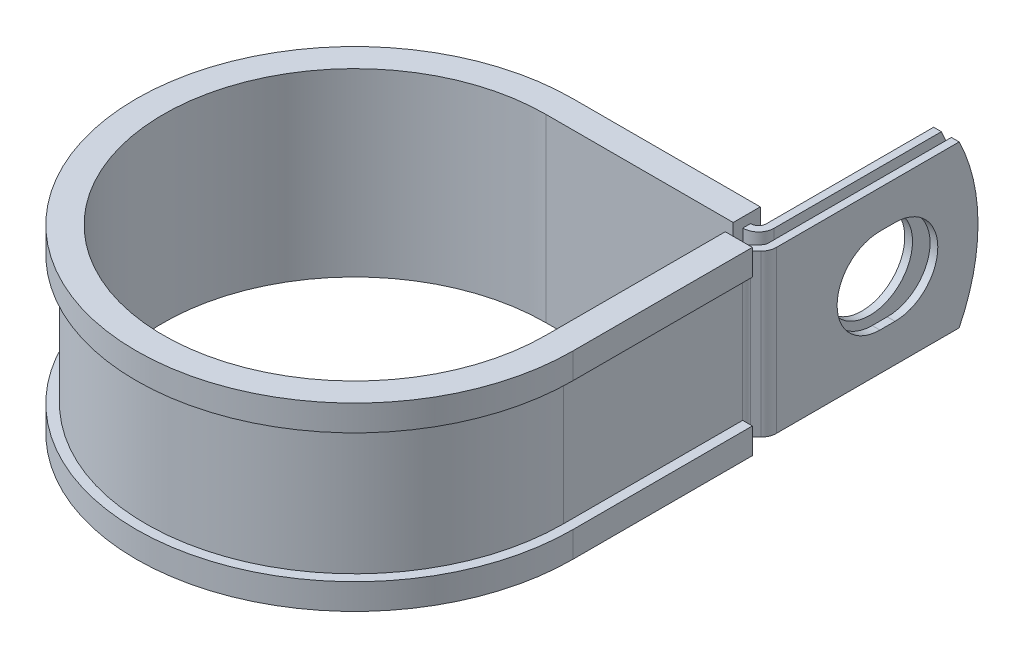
ISO-10303-21;
HEADER;
FILE_DESCRIPTION(('STEP AP214'),'2;1');
FILE_NAME('part.step','',(''),(''),'','','');
FILE_SCHEMA(('AUTOMOTIVE_DESIGN { 1 0 10303 214 1 1 1 1 }'));
ENDSEC;
DATA;
#1=APPLICATION_CONTEXT('core data for automotive mechanical design processes');
#2=APPLICATION_PROTOCOL_DEFINITION('international standard','automotive_design',2000,#1);
#3=PRODUCT_CONTEXT('',#1,'mechanical');
#4=PRODUCT('Part','Part','',(#3));
#5=PRODUCT_RELATED_PRODUCT_CATEGORY('part','',(#4));
#6=PRODUCT_DEFINITION_FORMATION('','',#4);
#7=PRODUCT_DEFINITION_CONTEXT('part definition',#1,'design');
#8=PRODUCT_DEFINITION('design','',#6,#7);
#9=PRODUCT_DEFINITION_SHAPE('','',#8);
#10=(LENGTH_UNIT() NAMED_UNIT(*) SI_UNIT(.MILLI.,.METRE.));
#11=(NAMED_UNIT(*) PLANE_ANGLE_UNIT() SI_UNIT($,.RADIAN.));
#12=(NAMED_UNIT(*) SI_UNIT($,.STERADIAN.) SOLID_ANGLE_UNIT());
#13=UNCERTAINTY_MEASURE_WITH_UNIT(LENGTH_MEASURE(1.E-05),#10,'distance_accuracy_value','');
#14=(GEOMETRIC_REPRESENTATION_CONTEXT(3) GLOBAL_UNCERTAINTY_ASSIGNED_CONTEXT((#13)) GLOBAL_UNIT_ASSIGNED_CONTEXT((#10,
#11,#12)) REPRESENTATION_CONTEXT('',''));
#15=CARTESIAN_POINT('',(0.,0.,0.));
#16=DIRECTION('',(0.,0.,1.));
#17=DIRECTION('',(1.,0.,0.));
#18=AXIS2_PLACEMENT_3D('',#15,#16,#17);
#19=CARTESIAN_POINT('',(32.3647698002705,-12.7,-31.6865));
#20=DIRECTION('',(0.,1.,0.));
#21=DIRECTION('',(1.,0.,0.));
#22=AXIS2_PLACEMENT_3D('',#19,#20,#21);
#23=PLANE('',#22);
#24=DIRECTION('',(0.,0.,-1.));
#25=VECTOR('',#24,1.);
#26=CARTESIAN_POINT('',(29.5199698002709,-12.7,-31.6865));
#27=LINE('',#26,#25);
#28=CARTESIAN_POINT('',(29.5199698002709,-12.7,-31.6865));
#29=VERTEX_POINT('',#28);
#30=CARTESIAN_POINT('',(29.5199698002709,-12.7,-32.9057));
#31=VERTEX_POINT('',#30);
#32=EDGE_CURVE('E505',#29,#31,#27,.T.);
#33=ORIENTED_EDGE('',*,*,#32,.T.);
#34=DIRECTION('',(1.,0.,0.));
#35=VECTOR('',#34,1.);
#36=CARTESIAN_POINT('',(0.,-12.7,-32.9057));
#37=LINE('',#36,#35);
#38=CARTESIAN_POINT('',(29.5707698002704,-12.7,-32.9057));
#39=VERTEX_POINT('',#38);
#40=EDGE_CURVE('E392',#39,#31,#37,.F.);
#41=ORIENTED_EDGE('',*,*,#40,.F.);
#42=CARTESIAN_POINT('',(29.5707698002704,-12.7,-34.1249));
#43=DIRECTION('',(0.,1.,0.));
#44=DIRECTION('',(1.,0.,0.));
#45=AXIS2_PLACEMENT_3D('',#42,#43,#44);
#46=CIRCLE('',#45,1.2192);
#47=CARTESIAN_POINT('',(30.7899698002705,-12.7,-34.1249));
#48=VERTEX_POINT('',#47);
#49=EDGE_CURVE('E390',#48,#39,#46,.F.);
#50=ORIENTED_EDGE('',*,*,#49,.F.);
#51=DIRECTION('',(0.,0.,1.));
#52=VECTOR('',#51,1.);
#53=CARTESIAN_POINT('',(30.7899698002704,-12.7,-63.4746));
#54=LINE('',#53,#52);
#55=CARTESIAN_POINT('',(30.7899698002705,-12.7,-60.4972683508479));
#56=VERTEX_POINT('',#55);
#57=EDGE_CURVE('E388',#56,#48,#54,.T.);
#58=ORIENTED_EDGE('',*,*,#57,.F.);
#59=DIRECTION('',(-1.,0.,0.));
#60=VECTOR('',#59,1.);
#61=CARTESIAN_POINT('',(34.8031698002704,-12.7,-60.4972683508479));
#62=LINE('',#61,#60);
#63=CARTESIAN_POINT('',(32.0091698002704,-12.7,-60.4972683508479));
#64=VERTEX_POINT('',#63);
#65=EDGE_CURVE('E11',#64,#56,#62,.T.);
#66=ORIENTED_EDGE('',*,*,#65,.F.);
#67=DIRECTION('',(0.,0.,1.));
#68=VECTOR('',#67,1.);
#69=CARTESIAN_POINT('',(32.0091698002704,-12.7,-63.4746));
#70=LINE('',#69,#68);
#71=CARTESIAN_POINT('',(32.0091698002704,-12.7,-34.1249));
#72=VERTEX_POINT('',#71);
#73=EDGE_CURVE('E386',#64,#72,#70,.T.);
#74=ORIENTED_EDGE('',*,*,#73,.T.);
#75=CARTESIAN_POINT('',(29.5707698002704,-12.7,-34.1249));
#76=DIRECTION('',(0.,-1.,0.));
#77=DIRECTION('',(0.,0.,1.));
#78=AXIS2_PLACEMENT_3D('',#75,#76,#77);
#79=CIRCLE('',#78,2.4384);
#80=CARTESIAN_POINT('',(29.5707698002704,-12.7,-31.6865));
#81=VERTEX_POINT('',#80);
#82=EDGE_CURVE('E383',#72,#81,#79,.T.);
#83=ORIENTED_EDGE('',*,*,#82,.T.);
#84=DIRECTION('',(-1.,0.,0.));
#85=VECTOR('',#84,1.);
#86=CARTESIAN_POINT('',(0.,-12.7,-31.6865));
#87=LINE('',#86,#85);
#88=EDGE_CURVE('E380',#81,#29,#87,.T.);
#89=ORIENTED_EDGE('',*,*,#88,.T.);
#90=EDGE_LOOP('',(#33,#41,#50,#58,#66,#74,#83,#89));
#91=FACE_BOUND('',#90,.T.);
#92=ADVANCED_FACE('F36',(#91),#23,.F.);
#93=CARTESIAN_POINT('',(32.3647698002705,12.7,-31.6865));
#94=DIRECTION('',(0.,1.,0.));
#95=DIRECTION('',(1.,0.,0.));
#96=AXIS2_PLACEMENT_3D('',#93,#94,#95);
#97=PLANE('',#96);
#98=DIRECTION('',(1.,0.,0.));
#99=VECTOR('',#98,1.);
#100=CARTESIAN_POINT('',(0.,12.7,-32.9057));
#101=LINE('',#100,#99);
#102=CARTESIAN_POINT('',(29.5707698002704,12.7,-32.9057));
#103=VERTEX_POINT('',#102);
#104=CARTESIAN_POINT('',(29.5199698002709,12.7,-32.9057));
#105=VERTEX_POINT('',#104);
#106=EDGE_CURVE('E350',#103,#105,#101,.F.);
#107=ORIENTED_EDGE('',*,*,#106,.T.);
#108=DIRECTION('',(0.,0.,1.));
#109=VECTOR('',#108,1.);
#110=CARTESIAN_POINT('',(29.5199698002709,12.7,-32.9057));
#111=LINE('',#110,#109);
#112=CARTESIAN_POINT('',(29.5199698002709,12.7,-31.6865));
#113=VERTEX_POINT('',#112);
#114=EDGE_CURVE('E499',#105,#113,#111,.T.);
#115=ORIENTED_EDGE('',*,*,#114,.T.);
#116=DIRECTION('',(-1.,0.,0.));
#117=VECTOR('',#116,1.);
#118=CARTESIAN_POINT('',(0.,12.7,-31.6865));
#119=LINE('',#118,#117);
#120=CARTESIAN_POINT('',(29.5707698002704,12.7,-31.6865));
#121=VERTEX_POINT('',#120);
#122=EDGE_CURVE('E607',#121,#113,#119,.T.);
#123=ORIENTED_EDGE('',*,*,#122,.F.);
#124=CARTESIAN_POINT('',(29.5707698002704,12.7,-34.1249));
#125=DIRECTION('',(0.,-1.,0.));
#126=DIRECTION('',(0.,0.,1.));
#127=AXIS2_PLACEMENT_3D('',#124,#125,#126);
#128=CIRCLE('',#127,2.4384);
#129=CARTESIAN_POINT('',(32.0091698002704,12.7,-34.1249));
#130=VERTEX_POINT('',#129);
#131=EDGE_CURVE('E352',#130,#121,#128,.T.);
#132=ORIENTED_EDGE('',*,*,#131,.F.);
#133=DIRECTION('',(0.,0.,1.));
#134=VECTOR('',#133,1.);
#135=CARTESIAN_POINT('',(32.0091698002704,12.7,-63.4746));
#136=LINE('',#135,#134);
#137=CARTESIAN_POINT('',(32.0091698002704,12.7,-60.4972683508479));
#138=VERTEX_POINT('',#137);
#139=EDGE_CURVE('E343',#138,#130,#136,.T.);
#140=ORIENTED_EDGE('',*,*,#139,.F.);
#141=DIRECTION('',(-1.,0.,0.));
#142=VECTOR('',#141,1.);
#143=CARTESIAN_POINT('',(34.8031698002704,12.7,-60.4972683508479));
#144=LINE('',#143,#142);
#145=CARTESIAN_POINT('',(30.7899698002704,12.7,-60.4972683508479));
#146=VERTEX_POINT('',#145);
#147=EDGE_CURVE('E44',#138,#146,#144,.T.);
#148=ORIENTED_EDGE('',*,*,#147,.T.);
#149=DIRECTION('',(0.,0.,1.));
#150=VECTOR('',#149,1.);
#151=CARTESIAN_POINT('',(30.7899698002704,12.7,-63.4746));
#152=LINE('',#151,#150);
#153=CARTESIAN_POINT('',(30.7899698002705,12.7,-34.1249));
#154=VERTEX_POINT('',#153);
#155=EDGE_CURVE('E340',#146,#154,#152,.T.);
#156=ORIENTED_EDGE('',*,*,#155,.T.);
#157=CARTESIAN_POINT('',(29.5707698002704,12.7,-34.1249));
#158=DIRECTION('',(0.,1.,0.));
#159=DIRECTION('',(1.,0.,0.));
#160=AXIS2_PLACEMENT_3D('',#157,#158,#159);
#161=CIRCLE('',#160,1.2192);
#162=EDGE_CURVE('E348',#154,#103,#161,.F.);
#163=ORIENTED_EDGE('',*,*,#162,.T.);
#164=EDGE_LOOP('',(#107,#115,#123,#132,#140,#148,#156,#163));
#165=FACE_BOUND('',#164,.T.);
#166=ADVANCED_FACE('F339',(#165),#97,.T.);
#167=CARTESIAN_POINT('',(0.,12.7,-31.6865));
#168=DIRECTION('',(0.,0.,1.));
#169=DIRECTION('',(1.,0.,0.));
#170=AXIS2_PLACEMENT_3D('',#167,#168,#169);
#171=PLANE('',#170);
#172=ORIENTED_EDGE('',*,*,#122,.T.);
#173=DIRECTION('',(0.,-1.,0.));
#174=VECTOR('',#173,1.);
#175=CARTESIAN_POINT('',(29.5199698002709,12.7,-31.6865));
#176=LINE('',#175,#174);
#177=EDGE_CURVE('E502',#113,#29,#176,.T.);
#178=ORIENTED_EDGE('',*,*,#177,.T.);
#179=ORIENTED_EDGE('',*,*,#88,.F.);
#180=DIRECTION('',(0.,-1.,0.));
#181=VECTOR('',#180,1.);
#182=CARTESIAN_POINT('',(29.5707698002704,12.7,-31.6865));
#183=LINE('',#182,#181);
#184=EDGE_CURVE('E326',#121,#81,#183,.T.);
#185=ORIENTED_EDGE('',*,*,#184,.F.);
#186=EDGE_LOOP('',(#172,#178,#179,#185));
#187=FACE_BOUND('',#186,.T.);
#188=ADVANCED_FACE('F617',(#187),#171,.T.);
#189=CARTESIAN_POINT('',(34.8031698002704,12.7,-31.6865));
#190=DIRECTION('',(-1.,0.,0.));
#191=DIRECTION('',(0.,0.,1.));
#192=AXIS2_PLACEMENT_3D('',#189,#190,#191);
#193=PLANE('',#192);
#194=CARTESIAN_POINT('',(34.8031698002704,0.,-50.3935999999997));
#195=DIRECTION('',(1.,0.,0.));
#196=DIRECTION('',(0.,0.,-1.));
#197=AXIS2_PLACEMENT_3D('',#194,#195,#196);
#198=CIRCLE('',#197,6.7437);
#199=CARTESIAN_POINT('',(34.8031698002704,-6.7437,-50.3936000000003));
#200=VERTEX_POINT('',#199);
#201=CARTESIAN_POINT('',(34.8031698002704,6.7437,-50.3936000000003));
#202=VERTEX_POINT('',#201);
#203=EDGE_CURVE('E562',#200,#202,#198,.T.);
#204=ORIENTED_EDGE('',*,*,#203,.F.);
#205=DIRECTION('',(0.,0.,-1.));
#206=VECTOR('',#205,1.);
#207=CARTESIAN_POINT('',(34.8031698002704,-6.7437,-48.0059999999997));
#208=LINE('',#207,#206);
#209=CARTESIAN_POINT('',(34.8031698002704,-6.7437,-48.0059999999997));
#210=VERTEX_POINT('',#209);
#211=EDGE_CURVE('E565',#210,#200,#208,.T.);
#212=ORIENTED_EDGE('',*,*,#211,.F.);
#213=CARTESIAN_POINT('',(34.8031698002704,0.,-48.0059999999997));
#214=DIRECTION('',(1.,0.,0.));
#215=DIRECTION('',(0.,0.,-1.));
#216=AXIS2_PLACEMENT_3D('',#213,#214,#215);
#217=CIRCLE('',#216,6.7437);
#218=CARTESIAN_POINT('',(34.8031698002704,6.7437,-48.0059999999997));
#219=VERTEX_POINT('',#218);
#220=EDGE_CURVE('E558',#219,#210,#217,.T.);
#221=ORIENTED_EDGE('',*,*,#220,.F.);
#222=DIRECTION('',(0.,0.,1.));
#223=VECTOR('',#222,1.);
#224=CARTESIAN_POINT('',(34.8031698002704,6.7437,-48.0059999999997));
#225=LINE('',#224,#223);
#226=EDGE_CURVE('E559',#202,#219,#225,.T.);
#227=ORIENTED_EDGE('',*,*,#226,.F.);
#228=EDGE_LOOP('',(#204,#212,#221,#227));
#229=FACE_BOUND('',#228,.T.);
#230=DIRECTION('',(0.,0.,-1.));
#231=VECTOR('',#230,1.);
#232=CARTESIAN_POINT('',(34.8031698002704,-12.7,-31.6865));
#233=LINE('',#232,#231);
#234=CARTESIAN_POINT('',(34.8031698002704,-12.7,-31.6865));
#235=VERTEX_POINT('',#234);
#236=CARTESIAN_POINT('',(34.8031698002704,-12.7,-60.4972683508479));
#237=VERTEX_POINT('',#236);
#238=EDGE_CURVE('E364',#235,#237,#233,.T.);
#239=ORIENTED_EDGE('',*,*,#238,.T.);
#240=CARTESIAN_POINT('',(34.8031698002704,0.,-34.8996));
#241=DIRECTION('',(-1.,0.,0.));
#242=DIRECTION('',(0.,0.,1.));
#243=AXIS2_PLACEMENT_3D('',#240,#241,#242);
#244=CIRCLE('',#243,28.575);
#245=CARTESIAN_POINT('',(34.8031698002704,12.7,-60.4972683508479));
#246=VERTEX_POINT('',#245);
#247=EDGE_CURVE('E550',#246,#237,#244,.T.);
#248=ORIENTED_EDGE('',*,*,#247,.F.);
#249=DIRECTION('',(0.,0.,-1.));
#250=VECTOR('',#249,1.);
#251=CARTESIAN_POINT('',(34.8031698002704,12.7,-31.6865));
#252=LINE('',#251,#250);
#253=CARTESIAN_POINT('',(34.8031698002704,12.7,-31.6865));
#254=VERTEX_POINT('',#253);
#255=EDGE_CURVE('E401',#254,#246,#252,.T.);
#256=ORIENTED_EDGE('',*,*,#255,.F.);
#257=DIRECTION('',(0.,-1.,0.));
#258=VECTOR('',#257,1.);
#259=CARTESIAN_POINT('',(34.8031698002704,12.7,-31.6865));
#260=LINE('',#259,#258);
#261=EDGE_CURVE('E363',#254,#235,#260,.T.);
#262=ORIENTED_EDGE('',*,*,#261,.T.);
#263=EDGE_LOOP('',(#239,#248,#256,#262));
#264=FACE_BOUND('',#263,.T.);
#265=ADVANCED_FACE('F38',(#229,#264),#193,.F.);
#266=CARTESIAN_POINT('',(33.5839698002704,12.7,-31.6865));
#267=DIRECTION('',(-1.,0.,0.));
#268=DIRECTION('',(0.,0.,1.));
#269=AXIS2_PLACEMENT_3D('',#266,#267,#268);
#270=PLANE('',#269);
#271=DIRECTION('',(0.,0.,-1.));
#272=VECTOR('',#271,1.);
#273=CARTESIAN_POINT('',(33.5839698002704,-6.7437,-48.0059999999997));
#274=LINE('',#273,#272);
#275=CARTESIAN_POINT('',(33.5839698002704,-6.7437,-48.0059999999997));
#276=VERTEX_POINT('',#275);
#277=CARTESIAN_POINT('',(33.5839698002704,-6.7437,-50.3936000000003));
#278=VERTEX_POINT('',#277);
#279=EDGE_CURVE('E561',#276,#278,#274,.T.);
#280=ORIENTED_EDGE('',*,*,#279,.T.);
#281=CARTESIAN_POINT('',(33.5839698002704,0.,-50.3935999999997));
#282=DIRECTION('',(-1.,0.,0.));
#283=DIRECTION('',(0.,0.,1.));
#284=AXIS2_PLACEMENT_3D('',#281,#282,#283);
#285=CIRCLE('',#284,6.7437);
#286=CARTESIAN_POINT('',(33.5839698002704,6.7437,-50.3936000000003));
#287=VERTEX_POINT('',#286);
#288=EDGE_CURVE('E582',#278,#287,#285,.F.);
#289=ORIENTED_EDGE('',*,*,#288,.T.);
#290=DIRECTION('',(0.,0.,1.));
#291=VECTOR('',#290,1.);
#292=CARTESIAN_POINT('',(33.5839698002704,6.7437,-48.0059999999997));
#293=LINE('',#292,#291);
#294=CARTESIAN_POINT('',(33.5839698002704,6.7437,-48.0059999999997));
#295=VERTEX_POINT('',#294);
#296=EDGE_CURVE('E578',#287,#295,#293,.T.);
#297=ORIENTED_EDGE('',*,*,#296,.T.);
#298=CARTESIAN_POINT('',(33.5839698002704,0.,-48.0059999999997));
#299=DIRECTION('',(-1.,0.,0.));
#300=DIRECTION('',(0.,0.,1.));
#301=AXIS2_PLACEMENT_3D('',#298,#299,#300);
#302=CIRCLE('',#301,6.7437);
#303=EDGE_CURVE('E573',#295,#276,#302,.F.);
#304=ORIENTED_EDGE('',*,*,#303,.T.);
#305=EDGE_LOOP('',(#280,#289,#297,#304));
#306=FACE_BOUND('',#305,.T.);
#307=CARTESIAN_POINT('',(33.5839698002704,0.,-34.8996));
#308=DIRECTION('',(-1.,0.,0.));
#309=DIRECTION('',(0.,0.,1.));
#310=AXIS2_PLACEMENT_3D('',#307,#308,#309);
#311=CIRCLE('',#310,28.575);
#312=CARTESIAN_POINT('',(33.5839698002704,12.7,-60.4972683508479));
#313=VERTEX_POINT('',#312);
#314=CARTESIAN_POINT('',(33.5839698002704,-12.7,-60.4972683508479));
#315=VERTEX_POINT('',#314);
#316=EDGE_CURVE('E58',#313,#315,#311,.T.);
#317=ORIENTED_EDGE('',*,*,#316,.T.);
#318=DIRECTION('',(0.,0.,-1.));
#319=VECTOR('',#318,1.);
#320=CARTESIAN_POINT('',(33.5839698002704,-12.7,-31.6865));
#321=LINE('',#320,#319);
#322=CARTESIAN_POINT('',(33.5839698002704,-12.7,-31.6865));
#323=VERTEX_POINT('',#322);
#324=EDGE_CURVE('E367',#323,#315,#321,.T.);
#325=ORIENTED_EDGE('',*,*,#324,.F.);
#326=DIRECTION('',(0.,-1.,0.));
#327=VECTOR('',#326,1.);
#328=CARTESIAN_POINT('',(33.5839698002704,12.7,-31.6865));
#329=LINE('',#328,#327);
#330=CARTESIAN_POINT('',(33.5839698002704,12.7,-31.6865));
#331=VERTEX_POINT('',#330);
#332=EDGE_CURVE('E334',#331,#323,#329,.T.);
#333=ORIENTED_EDGE('',*,*,#332,.F.);
#334=DIRECTION('',(0.,0.,-1.));
#335=VECTOR('',#334,1.);
#336=CARTESIAN_POINT('',(33.5839698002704,12.7,-31.6865));
#337=LINE('',#336,#335);
#338=EDGE_CURVE('E597',#331,#313,#337,.T.);
#339=ORIENTED_EDGE('',*,*,#338,.T.);
#340=EDGE_LOOP('',(#317,#325,#333,#339));
#341=FACE_BOUND('',#340,.T.);
#342=ADVANCED_FACE('F671',(#306,#341),#270,.T.);
#343=CARTESIAN_POINT('',(32.0091698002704,12.7,-63.4746));
#344=DIRECTION('',(1.,0.,0.));
#345=DIRECTION('',(0.,0.,-1.));
#346=AXIS2_PLACEMENT_3D('',#343,#344,#345);
#347=PLANE('',#346);
#348=CARTESIAN_POINT('',(32.0091698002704,0.,-49.1998));
#349=DIRECTION('',(1.,0.,0.));
#350=DIRECTION('',(0.,0.,-1.));
#351=AXIS2_PLACEMENT_3D('',#348,#349,#350);
#352=CIRCLE('',#351,6.7437);
#353=CARTESIAN_POINT('',(32.0091698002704,0.,-55.9435));
#354=VERTEX_POINT('',#353);
#355=EDGE_CURVE('E368',#354,#354,#352,.F.);
#356=ORIENTED_EDGE('',*,*,#355,.T.);
#357=EDGE_LOOP('',(#356));
#358=FACE_BOUND('',#357,.T.);
#359=ORIENTED_EDGE('',*,*,#73,.F.);
#360=CARTESIAN_POINT('',(32.0091698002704,0.,-34.8996));
#361=DIRECTION('',(1.,0.,0.));
#362=DIRECTION('',(0.,0.,-1.));
#363=AXIS2_PLACEMENT_3D('',#360,#361,#362);
#364=CIRCLE('',#363,28.575);
#365=EDGE_CURVE('E555',#64,#138,#364,.T.);
#366=ORIENTED_EDGE('',*,*,#365,.T.);
#367=ORIENTED_EDGE('',*,*,#139,.T.);
#368=DIRECTION('',(0.,-1.,0.));
#369=VECTOR('',#368,1.);
#370=CARTESIAN_POINT('',(32.0091698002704,12.7,-34.1249));
#371=LINE('',#370,#369);
#372=EDGE_CURVE('E323',#130,#72,#371,.T.);
#373=ORIENTED_EDGE('',*,*,#372,.T.);
#374=EDGE_LOOP('',(#359,#366,#367,#373));
#375=FACE_BOUND('',#374,.T.);
#376=ADVANCED_FACE('F623',(#358,#375),#347,.T.);
#377=CARTESIAN_POINT('',(30.7899698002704,12.7,-63.4746));
#378=DIRECTION('',(1.,0.,0.));
#379=DIRECTION('',(0.,0.,-1.));
#380=AXIS2_PLACEMENT_3D('',#377,#378,#379);
#381=PLANE('',#380);
#382=CARTESIAN_POINT('',(30.7899698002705,0.,-49.1998));
#383=DIRECTION('',(-1.,0.,0.));
#384=DIRECTION('',(0.,0.,1.));
#385=AXIS2_PLACEMENT_3D('',#382,#383,#384);
#386=CIRCLE('',#385,6.7437);
#387=CARTESIAN_POINT('',(30.7899698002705,0.,-42.4561));
#388=VERTEX_POINT('',#387);
#389=EDGE_CURVE('E590',#388,#388,#386,.T.);
#390=ORIENTED_EDGE('',*,*,#389,.F.);
#391=EDGE_LOOP('',(#390));
#392=FACE_BOUND('',#391,.T.);
#393=CARTESIAN_POINT('',(30.7899698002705,0.,-34.8996));
#394=DIRECTION('',(-1.,0.,0.));
#395=DIRECTION('',(0.,0.,1.));
#396=AXIS2_PLACEMENT_3D('',#393,#394,#395);
#397=CIRCLE('',#396,28.575);
#398=EDGE_CURVE('E50',#146,#56,#397,.T.);
#399=ORIENTED_EDGE('',*,*,#398,.T.);
#400=ORIENTED_EDGE('',*,*,#57,.T.);
#401=DIRECTION('',(0.,-1.,0.));
#402=VECTOR('',#401,1.);
#403=CARTESIAN_POINT('',(30.7899698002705,12.7,-34.1249));
#404=LINE('',#403,#402);
#405=EDGE_CURVE('E320',#154,#48,#404,.T.);
#406=ORIENTED_EDGE('',*,*,#405,.F.);
#407=ORIENTED_EDGE('',*,*,#155,.F.);
#408=EDGE_LOOP('',(#399,#400,#406,#407));
#409=FACE_BOUND('',#408,.T.);
#410=ADVANCED_FACE('F346',(#392,#409),#381,.F.);
#411=CARTESIAN_POINT('',(34.1249,-12.7,-28.2740026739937));
#412=DIRECTION('',(0.,1.,0.));
#413=DIRECTION('',(1.,0.,0.));
#414=AXIS2_PLACEMENT_3D('',#411,#412,#413);
#415=CIRCLE('',#414,1.2192);
#416=CARTESIAN_POINT('',(32.9057,-12.7,-28.2740026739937));
#417=VERTEX_POINT('',#416);
#418=CARTESIAN_POINT('',(33.2627954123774,-12.7,-29.1361072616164));
#419=VERTEX_POINT('',#418);
#420=EDGE_CURVE('E395',#417,#419,#415,.F.);
#421=ORIENTED_EDGE('',*,*,#420,.F.);
#422=DIRECTION('',(1.,0.,0.));
#423=VECTOR('',#422,1.);
#424=CARTESIAN_POINT('',(31.6865,-12.7,-28.2740026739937));
#425=LINE('',#424,#423);
#426=CARTESIAN_POINT('',(31.6865,-12.7,-28.2740026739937));
#427=VERTEX_POINT('',#426);
#428=EDGE_CURVE('E433',#427,#417,#425,.T.);
#429=ORIENTED_EDGE('',*,*,#428,.F.);
#430=CARTESIAN_POINT('',(34.1249,-12.7,-28.2740026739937));
#431=DIRECTION('',(0.,-1.,0.));
#432=DIRECTION('',(0.,0.,1.));
#433=AXIS2_PLACEMENT_3D('',#430,#431,#432);
#434=CIRCLE('',#433,2.4384);
#435=CARTESIAN_POINT('',(32.4006908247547,-12.7,-29.998211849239));
#436=VERTEX_POINT('',#435);
#437=EDGE_CURVE('E377',#427,#436,#434,.T.);
#438=ORIENTED_EDGE('',*,*,#437,.T.);
#439=DIRECTION('',(0.707106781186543,0.,-0.707106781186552));
#440=VECTOR('',#439,1.);
#441=CARTESIAN_POINT('',(32.4006908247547,-12.7,-29.998211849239));
#442=LINE('',#441,#440);
#443=CARTESIAN_POINT('',(33.2268743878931,-12.7,-30.8243954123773));
#444=VERTEX_POINT('',#443);
#445=EDGE_CURVE('E374',#436,#444,#442,.T.);
#446=ORIENTED_EDGE('',*,*,#445,.T.);
#447=CARTESIAN_POINT('',(32.3647698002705,-12.7,-31.6865));
#448=DIRECTION('',(0.,1.,0.));
#449=DIRECTION('',(0.,0.,1.));
#450=AXIS2_PLACEMENT_3D('',#447,#448,#449);
#451=CIRCLE('',#450,1.21919999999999);
#452=EDGE_CURVE('E371',#444,#323,#451,.T.);
#453=ORIENTED_EDGE('',*,*,#452,.T.);
#454=ORIENTED_EDGE('',*,*,#324,.T.);
#455=DIRECTION('',(-1.,0.,0.));
#456=VECTOR('',#455,1.);
#457=CARTESIAN_POINT('',(34.8031698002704,-12.7,-60.4972683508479));
#458=LINE('',#457,#456);
#459=EDGE_CURVE('E548',#237,#315,#458,.T.);
#460=ORIENTED_EDGE('',*,*,#459,.F.);
#461=ORIENTED_EDGE('',*,*,#238,.F.);
#462=CARTESIAN_POINT('',(32.3647698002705,-12.7,-31.6865));
#463=DIRECTION('',(0.,1.,0.));
#464=DIRECTION('',(1.,0.,0.));
#465=AXIS2_PLACEMENT_3D('',#462,#463,#464);
#466=CIRCLE('',#465,2.43839999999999);
#467=CARTESIAN_POINT('',(34.0889789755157,-12.7,-29.9622908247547));
#468=VERTEX_POINT('',#467);
#469=EDGE_CURVE('E399',#468,#235,#466,.T.);
#470=ORIENTED_EDGE('',*,*,#469,.F.);
#471=DIRECTION('',(0.707106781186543,0.,-0.707106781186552));
#472=VECTOR('',#471,1.);
#473=CARTESIAN_POINT('',(33.2627954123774,-12.7,-29.1361072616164));
#474=LINE('',#473,#472);
#475=EDGE_CURVE('E397',#419,#468,#474,.T.);
#476=ORIENTED_EDGE('',*,*,#475,.F.);
#477=EDGE_LOOP('',(#421,#429,#438,#446,#453,#454,#460,#461,#470,#476));
#478=FACE_BOUND('',#477,.T.);
#479=ADVANCED_FACE('F657',(#478),#23,.F.);
#480=DIRECTION('',(-1.,0.,0.));
#481=VECTOR('',#480,1.);
#482=CARTESIAN_POINT('',(32.9057,12.7,-28.2740026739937));
#483=LINE('',#482,#481);
#484=CARTESIAN_POINT('',(32.9057,12.7,-28.2740026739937));
#485=VERTEX_POINT('',#484);
#486=CARTESIAN_POINT('',(31.6865,12.7,-28.2740026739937));
#487=VERTEX_POINT('',#486);
#488=EDGE_CURVE('E422',#485,#487,#483,.T.);
#489=ORIENTED_EDGE('',*,*,#488,.F.);
#490=CARTESIAN_POINT('',(34.1249,12.7,-28.2740026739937));
#491=DIRECTION('',(0.,1.,0.));
#492=DIRECTION('',(1.,0.,0.));
#493=AXIS2_PLACEMENT_3D('',#490,#491,#492);
#494=CIRCLE('',#493,1.2192);
#495=CARTESIAN_POINT('',(33.2627954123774,12.7,-29.1361072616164));
#496=VERTEX_POINT('',#495);
#497=EDGE_CURVE('E357',#485,#496,#494,.F.);
#498=ORIENTED_EDGE('',*,*,#497,.T.);
#499=DIRECTION('',(0.707106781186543,0.,-0.707106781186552));
#500=VECTOR('',#499,1.);
#501=CARTESIAN_POINT('',(33.2627954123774,12.7,-29.1361072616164));
#502=LINE('',#501,#500);
#503=CARTESIAN_POINT('',(34.0889789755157,12.7,-29.9622908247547));
#504=VERTEX_POINT('',#503);
#505=EDGE_CURVE('E359',#496,#504,#502,.T.);
#506=ORIENTED_EDGE('',*,*,#505,.T.);
#507=CARTESIAN_POINT('',(32.3647698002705,12.7,-31.6865));
#508=DIRECTION('',(0.,1.,0.));
#509=DIRECTION('',(1.,0.,0.));
#510=AXIS2_PLACEMENT_3D('',#507,#508,#509);
#511=CIRCLE('',#510,2.43839999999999);
#512=EDGE_CURVE('E361',#504,#254,#511,.T.);
#513=ORIENTED_EDGE('',*,*,#512,.T.);
#514=ORIENTED_EDGE('',*,*,#255,.T.);
#515=DIRECTION('',(-1.,0.,0.));
#516=VECTOR('',#515,1.);
#517=CARTESIAN_POINT('',(34.8031698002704,12.7,-60.4972683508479));
#518=LINE('',#517,#516);
#519=EDGE_CURVE('E552',#246,#313,#518,.T.);
#520=ORIENTED_EDGE('',*,*,#519,.T.);
#521=ORIENTED_EDGE('',*,*,#338,.F.);
#522=CARTESIAN_POINT('',(32.3647698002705,12.7,-31.6865));
#523=DIRECTION('',(0.,1.,0.));
#524=DIRECTION('',(0.,0.,1.));
#525=AXIS2_PLACEMENT_3D('',#522,#523,#524);
#526=CIRCLE('',#525,1.21919999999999);
#527=CARTESIAN_POINT('',(33.2268743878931,12.7,-30.8243954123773));
#528=VERTEX_POINT('',#527);
#529=EDGE_CURVE('E600',#528,#331,#526,.T.);
#530=ORIENTED_EDGE('',*,*,#529,.F.);
#531=DIRECTION('',(0.707106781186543,0.,-0.707106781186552));
#532=VECTOR('',#531,1.);
#533=CARTESIAN_POINT('',(32.4006908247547,12.7,-29.998211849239));
#534=LINE('',#533,#532);
#535=CARTESIAN_POINT('',(32.4006908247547,12.7,-29.998211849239));
#536=VERTEX_POINT('',#535);
#537=EDGE_CURVE('E603',#536,#528,#534,.T.);
#538=ORIENTED_EDGE('',*,*,#537,.F.);
#539=CARTESIAN_POINT('',(34.1249,12.7,-28.2740026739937));
#540=DIRECTION('',(0.,-1.,0.));
#541=DIRECTION('',(0.,0.,1.));
#542=AXIS2_PLACEMENT_3D('',#539,#540,#541);
#543=CIRCLE('',#542,2.4384);
#544=EDGE_CURVE('E432',#487,#536,#543,.T.);
#545=ORIENTED_EDGE('',*,*,#544,.F.);
#546=EDGE_LOOP('',(#489,#498,#506,#513,#514,#520,#521,#530,#538,#545));
#547=FACE_BOUND('',#546,.T.);
#548=ADVANCED_FACE('F429',(#547),#97,.T.);
#549=CARTESIAN_POINT('',(32.3647698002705,12.7,-31.6865));
#550=DIRECTION('',(0.,-1.,0.));
#551=DIRECTION('',(0.,0.,-1.));
#552=AXIS2_PLACEMENT_3D('',#549,#550,#551);
#553=CYLINDRICAL_SURFACE('',#552,1.21919999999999);
#554=ORIENTED_EDGE('',*,*,#452,.F.);
#555=DIRECTION('',(0.,-1.,0.));
#556=VECTOR('',#555,1.);
#557=CARTESIAN_POINT('',(33.2268743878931,12.7,-30.8243954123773));
#558=LINE('',#557,#556);
#559=EDGE_CURVE('E332',#528,#444,#558,.T.);
#560=ORIENTED_EDGE('',*,*,#559,.F.);
#561=ORIENTED_EDGE('',*,*,#529,.T.);
#562=ORIENTED_EDGE('',*,*,#332,.T.);
#563=EDGE_LOOP('',(#554,#560,#561,#562));
#564=FACE_BOUND('',#563,.T.);
#565=ADVANCED_FACE('F667',(#564),#553,.F.);
#566=CARTESIAN_POINT('',(32.4006908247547,12.7,-29.998211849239));
#567=DIRECTION('',(-0.707106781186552,0.,-0.707106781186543));
#568=DIRECTION('',(-0.707106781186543,0.,0.707106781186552));
#569=AXIS2_PLACEMENT_3D('',#566,#567,#568);
#570=PLANE('',#569);
#571=ORIENTED_EDGE('',*,*,#445,.F.);
#572=DIRECTION('',(0.,-1.,0.));
#573=VECTOR('',#572,1.);
#574=CARTESIAN_POINT('',(32.4006908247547,12.7,-29.998211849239));
#575=LINE('',#574,#573);
#576=EDGE_CURVE('E330',#536,#436,#575,.T.);
#577=ORIENTED_EDGE('',*,*,#576,.F.);
#578=ORIENTED_EDGE('',*,*,#537,.T.);
#579=ORIENTED_EDGE('',*,*,#559,.T.);
#580=EDGE_LOOP('',(#571,#577,#578,#579));
#581=FACE_BOUND('',#580,.T.);
#582=ADVANCED_FACE('F662',(#581),#570,.T.);
#583=CARTESIAN_POINT('',(34.1249,12.7,-28.2740026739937));
#584=DIRECTION('',(0.,-1.,0.));
#585=DIRECTION('',(0.,0.,-1.));
#586=AXIS2_PLACEMENT_3D('',#583,#584,#585);
#587=CYLINDRICAL_SURFACE('',#586,2.4384);
#588=ORIENTED_EDGE('',*,*,#437,.F.);
#589=DIRECTION('',(0.,-1.,0.));
#590=VECTOR('',#589,1.);
#591=CARTESIAN_POINT('',(31.6865,12.7,-28.2740026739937));
#592=LINE('',#591,#590);
#593=EDGE_CURVE('E328',#487,#427,#592,.T.);
#594=ORIENTED_EDGE('',*,*,#593,.F.);
#595=ORIENTED_EDGE('',*,*,#544,.T.);
#596=ORIENTED_EDGE('',*,*,#576,.T.);
#597=EDGE_LOOP('',(#588,#594,#595,#596));
#598=FACE_BOUND('',#597,.T.);
#599=ADVANCED_FACE('F659',(#598),#587,.T.);
#600=CARTESIAN_POINT('',(29.5707698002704,12.7,-34.1249));
#601=DIRECTION('',(0.,-1.,0.));
#602=DIRECTION('',(0.,0.,-1.));
#603=AXIS2_PLACEMENT_3D('',#600,#601,#602);
#604=CYLINDRICAL_SURFACE('',#603,2.4384);
#605=ORIENTED_EDGE('',*,*,#82,.F.);
#606=ORIENTED_EDGE('',*,*,#372,.F.);
#607=ORIENTED_EDGE('',*,*,#131,.T.);
#608=ORIENTED_EDGE('',*,*,#184,.T.);
#609=EDGE_LOOP('',(#605,#606,#607,#608));
#610=FACE_BOUND('',#609,.T.);
#611=ADVANCED_FACE('F613',(#610),#604,.T.);
#612=CARTESIAN_POINT('',(29.5707698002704,12.7,-34.1249));
#613=DIRECTION('',(0.,-1.,0.));
#614=DIRECTION('',(0.,0.,-1.));
#615=AXIS2_PLACEMENT_3D('',#612,#613,#614);
#616=CYLINDRICAL_SURFACE('',#615,1.2192);
#617=ORIENTED_EDGE('',*,*,#49,.T.);
#618=DIRECTION('',(0.,-1.,0.));
#619=VECTOR('',#618,1.);
#620=CARTESIAN_POINT('',(29.5707698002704,12.7,-32.9057));
#621=LINE('',#620,#619);
#622=EDGE_CURVE('E311',#103,#39,#621,.T.);
#623=ORIENTED_EDGE('',*,*,#622,.F.);
#624=ORIENTED_EDGE('',*,*,#162,.F.);
#625=ORIENTED_EDGE('',*,*,#405,.T.);
#626=EDGE_LOOP('',(#617,#623,#624,#625));
#627=FACE_BOUND('',#626,.T.);
#628=ADVANCED_FACE('F628',(#627),#616,.F.);
#629=CARTESIAN_POINT('',(0.,12.7,-32.9057));
#630=DIRECTION('',(0.,0.,1.));
#631=DIRECTION('',(1.,0.,0.));
#632=AXIS2_PLACEMENT_3D('',#629,#630,#631);
#633=PLANE('',#632);
#634=DIRECTION('',(0.,-1.,0.));
#635=VECTOR('',#634,1.);
#636=CARTESIAN_POINT('',(0.,12.7,-32.9057));
#637=LINE('',#636,#635);
#638=CARTESIAN_POINT('',(4.61573442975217E-13,10.16,-32.9057));
#639=VERTEX_POINT('',#638);
#640=CARTESIAN_POINT('',(4.61573442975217E-13,-10.16,-32.9057));
#641=VERTEX_POINT('',#640);
#642=EDGE_CURVE('E302',#639,#641,#637,.T.);
#643=ORIENTED_EDGE('',*,*,#642,.F.);
#644=DIRECTION('',(1.,0.,0.));
#645=VECTOR('',#644,1.);
#646=CARTESIAN_POINT('',(4.61573442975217E-13,10.16,-32.9057));
#647=LINE('',#646,#645);
#648=CARTESIAN_POINT('',(29.5199698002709,10.16,-32.9057));
#649=VERTEX_POINT('',#648);
#650=EDGE_CURVE('E545',#639,#649,#647,.T.);
#651=ORIENTED_EDGE('',*,*,#650,.T.);
#652=DIRECTION('',(0.,1.,0.));
#653=VECTOR('',#652,1.);
#654=CARTESIAN_POINT('',(29.5199698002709,12.7,-32.9057));
#655=LINE('',#654,#653);
#656=EDGE_CURVE('E496',#649,#105,#655,.T.);
#657=ORIENTED_EDGE('',*,*,#656,.T.);
#658=ORIENTED_EDGE('',*,*,#106,.F.);
#659=ORIENTED_EDGE('',*,*,#622,.T.);
#660=ORIENTED_EDGE('',*,*,#40,.T.);
#661=DIRECTION('',(0.,1.,0.));
#662=VECTOR('',#661,1.);
#663=CARTESIAN_POINT('',(29.5199698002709,-12.7,-32.9057));
#664=LINE('',#663,#662);
#665=CARTESIAN_POINT('',(29.5199698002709,-10.16,-32.9057));
#666=VERTEX_POINT('',#665);
#667=EDGE_CURVE('E508',#31,#666,#664,.T.);
#668=ORIENTED_EDGE('',*,*,#667,.T.);
#669=DIRECTION('',(1.,0.,0.));
#670=VECTOR('',#669,1.);
#671=CARTESIAN_POINT('',(4.61573442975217E-13,-10.16,-32.9057));
#672=LINE('',#671,#670);
#673=EDGE_CURVE('E525',#641,#666,#672,.T.);
#674=ORIENTED_EDGE('',*,*,#673,.F.);
#675=EDGE_LOOP('',(#643,#651,#657,#658,#659,#660,#668,#674));
#676=FACE_BOUND('',#675,.T.);
#677=ADVANCED_FACE('F632',(#676),#633,.F.);
#678=CARTESIAN_POINT('',(0.,12.7,0.));
#679=DIRECTION('',(0.,-1.,0.));
#680=DIRECTION('',(0.,0.,-1.));
#681=AXIS2_PLACEMENT_3D('',#678,#679,#680);
#682=CYLINDRICAL_SURFACE('',#681,32.9057);
#683=DIRECTION('',(0.,-1.,0.));
#684=VECTOR('',#683,1.);
#685=CARTESIAN_POINT('',(32.9057,12.7,0.));
#686=LINE('',#685,#684);
#687=CARTESIAN_POINT('',(32.9057,10.16,0.));
#688=VERTEX_POINT('',#687);
#689=CARTESIAN_POINT('',(32.9057,-10.16,0.));
#690=VERTEX_POINT('',#689);
#691=EDGE_CURVE('E300',#688,#690,#686,.T.);
#692=ORIENTED_EDGE('',*,*,#691,.F.);
#693=CARTESIAN_POINT('',(0.,10.16,0.));
#694=DIRECTION('',(0.,-1.,0.));
#695=DIRECTION('',(0.,0.,-1.));
#696=AXIS2_PLACEMENT_3D('',#693,#694,#695);
#697=CIRCLE('',#696,32.9057);
#698=EDGE_CURVE('E494',#688,#639,#697,.T.);
#699=ORIENTED_EDGE('',*,*,#698,.T.);
#700=ORIENTED_EDGE('',*,*,#642,.T.);
#701=CARTESIAN_POINT('',(0.,-10.16,0.));
#702=DIRECTION('',(0.,-1.,0.));
#703=DIRECTION('',(0.,0.,-1.));
#704=AXIS2_PLACEMENT_3D('',#701,#702,#703);
#705=CIRCLE('',#704,32.9057);
#706=EDGE_CURVE('E283',#690,#641,#705,.T.);
#707=ORIENTED_EDGE('',*,*,#706,.F.);
#708=EDGE_LOOP('',(#692,#699,#700,#707));
#709=FACE_BOUND('',#708,.T.);
#710=ADVANCED_FACE('F298',(#709),#682,.T.);
#711=CARTESIAN_POINT('',(32.9057,12.7,0.));
#712=DIRECTION('',(-1.,0.,0.));
#713=DIRECTION('',(0.,0.,1.));
#714=AXIS2_PLACEMENT_3D('',#711,#712,#713);
#715=PLANE('',#714);
#716=DIRECTION('',(0.,-1.,0.));
#717=VECTOR('',#716,1.);
#718=CARTESIAN_POINT('',(32.9057,12.7,-28.2740026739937));
#719=LINE('',#718,#717);
#720=CARTESIAN_POINT('',(32.9057,10.16,-28.2740026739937));
#721=VERTEX_POINT('',#720);
#722=CARTESIAN_POINT('',(32.9057,-10.16,-28.2740026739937));
#723=VERTEX_POINT('',#722);
#724=EDGE_CURVE('E314',#721,#723,#719,.T.);
#725=ORIENTED_EDGE('',*,*,#724,.F.);
#726=DIRECTION('',(0.,0.,-1.));
#727=VECTOR('',#726,1.);
#728=CARTESIAN_POINT('',(32.9057,10.16,0.));
#729=LINE('',#728,#727);
#730=EDGE_CURVE('E308',#688,#721,#729,.T.);
#731=ORIENTED_EDGE('',*,*,#730,.F.);
#732=ORIENTED_EDGE('',*,*,#691,.T.);
#733=DIRECTION('',(0.,0.,-1.));
#734=VECTOR('',#733,1.);
#735=CARTESIAN_POINT('',(32.9057,-10.16,0.));
#736=LINE('',#735,#734);
#737=EDGE_CURVE('E279',#690,#723,#736,.T.);
#738=ORIENTED_EDGE('',*,*,#737,.T.);
#739=EDGE_LOOP('',(#725,#731,#732,#738));
#740=FACE_BOUND('',#739,.T.);
#741=ADVANCED_FACE('F307',(#740),#715,.F.);
#742=CARTESIAN_POINT('',(34.1249,12.7,-28.2740026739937));
#743=DIRECTION('',(0.,-1.,0.));
#744=DIRECTION('',(0.,0.,-1.));
#745=AXIS2_PLACEMENT_3D('',#742,#743,#744);
#746=CYLINDRICAL_SURFACE('',#745,1.2192);
#747=ORIENTED_EDGE('',*,*,#420,.T.);
#748=DIRECTION('',(0.,-1.,0.));
#749=VECTOR('',#748,1.);
#750=CARTESIAN_POINT('',(33.2627954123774,12.7,-29.1361072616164));
#751=LINE('',#750,#749);
#752=EDGE_CURVE('E406',#496,#419,#751,.T.);
#753=ORIENTED_EDGE('',*,*,#752,.F.);
#754=ORIENTED_EDGE('',*,*,#497,.F.);
#755=EDGE_CURVE('E309',#485,#721,#719,.T.);
#756=ORIENTED_EDGE('',*,*,#755,.T.);
#757=ORIENTED_EDGE('',*,*,#724,.T.);
#758=DIRECTION('',(0.,1.,0.));
#759=VECTOR('',#758,1.);
#760=CARTESIAN_POINT('',(32.9057,-12.7,-28.2740026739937));
#761=LINE('',#760,#759);
#762=EDGE_CURVE('E415',#417,#723,#761,.T.);
#763=ORIENTED_EDGE('',*,*,#762,.F.);
#764=EDGE_LOOP('',(#747,#753,#754,#756,#757,#763));
#765=FACE_BOUND('',#764,.T.);
#766=ADVANCED_FACE('F414',(#765),#746,.F.);
#767=CARTESIAN_POINT('',(33.2627954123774,12.7,-29.1361072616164));
#768=DIRECTION('',(-0.707106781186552,0.,-0.707106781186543));
#769=DIRECTION('',(-0.707106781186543,0.,0.707106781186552));
#770=AXIS2_PLACEMENT_3D('',#767,#768,#769);
#771=PLANE('',#770);
#772=ORIENTED_EDGE('',*,*,#475,.T.);
#773=DIRECTION('',(0.,-1.,0.));
#774=VECTOR('',#773,1.);
#775=CARTESIAN_POINT('',(34.0889789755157,12.7,-29.9622908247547));
#776=LINE('',#775,#774);
#777=EDGE_CURVE('E404',#504,#468,#776,.T.);
#778=ORIENTED_EDGE('',*,*,#777,.F.);
#779=ORIENTED_EDGE('',*,*,#505,.F.);
#780=ORIENTED_EDGE('',*,*,#752,.T.);
#781=EDGE_LOOP('',(#772,#778,#779,#780));
#782=FACE_BOUND('',#781,.T.);
#783=ADVANCED_FACE('F683',(#782),#771,.F.);
#784=CARTESIAN_POINT('',(32.3647698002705,12.7,-31.6865));
#785=DIRECTION('',(0.,-1.,0.));
#786=DIRECTION('',(0.,0.,-1.));
#787=AXIS2_PLACEMENT_3D('',#784,#785,#786);
#788=CYLINDRICAL_SURFACE('',#787,2.43839999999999);
#789=ORIENTED_EDGE('',*,*,#469,.T.);
#790=ORIENTED_EDGE('',*,*,#261,.F.);
#791=ORIENTED_EDGE('',*,*,#512,.F.);
#792=ORIENTED_EDGE('',*,*,#777,.T.);
#793=EDGE_LOOP('',(#789,#790,#791,#792));
#794=FACE_BOUND('',#793,.T.);
#795=ADVANCED_FACE('F681',(#794),#788,.T.);
#796=CARTESIAN_POINT('',(51.0832338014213,0.,-49.1998));
#797=DIRECTION('',(-1.,0.,0.));
#798=DIRECTION('',(0.,0.,1.));
#799=AXIS2_PLACEMENT_3D('',#796,#797,#798);
#800=CYLINDRICAL_SURFACE('',#799,6.7437);
#801=ORIENTED_EDGE('',*,*,#389,.T.);
#802=EDGE_LOOP('',(#801));
#803=FACE_BOUND('',#802,.T.);
#804=ORIENTED_EDGE('',*,*,#355,.F.);
#805=EDGE_LOOP('',(#804));
#806=FACE_BOUND('',#805,.T.);
#807=ADVANCED_FACE('F690',(#803,#806),#800,.F.);
#808=CARTESIAN_POINT('',(12.7530892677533,-6.7437,-48.0059999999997));
#809=DIRECTION('',(0.,-1.,0.));
#810=DIRECTION('',(0.,0.,-1.));
#811=AXIS2_PLACEMENT_3D('',#808,#809,#810);
#812=PLANE('',#811);
#813=DIRECTION('',(1.,0.,0.));
#814=VECTOR('',#813,1.);
#815=CARTESIAN_POINT('',(12.7530892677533,-6.7437,-48.0059999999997));
#816=LINE('',#815,#814);
#817=EDGE_CURVE('E576',#276,#210,#816,.T.);
#818=ORIENTED_EDGE('',*,*,#817,.T.);
#819=ORIENTED_EDGE('',*,*,#211,.T.);
#820=DIRECTION('',(1.,0.,0.));
#821=VECTOR('',#820,1.);
#822=CARTESIAN_POINT('',(12.7530892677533,-6.7437,-50.3936000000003));
#823=LINE('',#822,#821);
#824=EDGE_CURVE('E572',#278,#200,#823,.T.);
#825=ORIENTED_EDGE('',*,*,#824,.F.);
#826=ORIENTED_EDGE('',*,*,#279,.F.);
#827=EDGE_LOOP('',(#818,#819,#825,#826));
#828=FACE_BOUND('',#827,.T.);
#829=ADVANCED_FACE('F733',(#828),#812,.F.);
#830=CARTESIAN_POINT('',(12.7530892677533,0.,-50.3935999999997));
#831=DIRECTION('',(1.,0.,0.));
#832=DIRECTION('',(0.,0.,-1.));
#833=AXIS2_PLACEMENT_3D('',#830,#831,#832);
#834=CYLINDRICAL_SURFACE('',#833,6.7437);
#835=ORIENTED_EDGE('',*,*,#824,.T.);
#836=ORIENTED_EDGE('',*,*,#203,.T.);
#837=DIRECTION('',(1.,0.,0.));
#838=VECTOR('',#837,1.);
#839=CARTESIAN_POINT('',(12.7530892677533,6.7437,-50.3936000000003));
#840=LINE('',#839,#838);
#841=EDGE_CURVE('E581',#287,#202,#840,.T.);
#842=ORIENTED_EDGE('',*,*,#841,.F.);
#843=ORIENTED_EDGE('',*,*,#288,.F.);
#844=EDGE_LOOP('',(#835,#836,#842,#843));
#845=FACE_BOUND('',#844,.T.);
#846=ADVANCED_FACE('F737',(#845),#834,.F.);
#847=CARTESIAN_POINT('',(12.7530892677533,6.7437,-48.0059999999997));
#848=DIRECTION('',(0.,1.,0.));
#849=DIRECTION('',(0.,0.,1.));
#850=AXIS2_PLACEMENT_3D('',#847,#848,#849);
#851=PLANE('',#850);
#852=ORIENTED_EDGE('',*,*,#841,.T.);
#853=ORIENTED_EDGE('',*,*,#226,.T.);
#854=DIRECTION('',(1.,0.,0.));
#855=VECTOR('',#854,1.);
#856=CARTESIAN_POINT('',(12.7530892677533,6.7437,-48.0059999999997));
#857=LINE('',#856,#855);
#858=EDGE_CURVE('E577',#295,#219,#857,.T.);
#859=ORIENTED_EDGE('',*,*,#858,.F.);
#860=ORIENTED_EDGE('',*,*,#296,.F.);
#861=EDGE_LOOP('',(#852,#853,#859,#860));
#862=FACE_BOUND('',#861,.T.);
#863=ADVANCED_FACE('F741',(#862),#851,.F.);
#864=CARTESIAN_POINT('',(12.7530892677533,0.,-48.0059999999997));
#865=DIRECTION('',(1.,0.,0.));
#866=DIRECTION('',(0.,0.,-1.));
#867=AXIS2_PLACEMENT_3D('',#864,#865,#866);
#868=CYLINDRICAL_SURFACE('',#867,6.7437);
#869=ORIENTED_EDGE('',*,*,#858,.T.);
#870=ORIENTED_EDGE('',*,*,#220,.T.);
#871=ORIENTED_EDGE('',*,*,#817,.F.);
#872=ORIENTED_EDGE('',*,*,#303,.F.);
#873=EDGE_LOOP('',(#869,#870,#871,#872));
#874=FACE_BOUND('',#873,.T.);
#875=ADVANCED_FACE('F745',(#874),#868,.F.);
#876=CARTESIAN_POINT('',(34.8031698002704,0.,-34.8996));
#877=DIRECTION('',(-1.,0.,0.));
#878=DIRECTION('',(0.,0.,1.));
#879=AXIS2_PLACEMENT_3D('',#876,#877,#878);
#880=CYLINDRICAL_SURFACE('',#879,28.575);
#881=ORIENTED_EDGE('',*,*,#365,.F.);
#882=ORIENTED_EDGE('',*,*,#65,.T.);
#883=ORIENTED_EDGE('',*,*,#398,.F.);
#884=ORIENTED_EDGE('',*,*,#147,.F.);
#885=EDGE_LOOP('',(#881,#882,#883,#884));
#886=FACE_BOUND('',#885,.T.);
#887=ADVANCED_FACE('F624',(#886),#880,.T.);
#888=ORIENTED_EDGE('',*,*,#519,.F.);
#889=ORIENTED_EDGE('',*,*,#247,.T.);
#890=ORIENTED_EDGE('',*,*,#459,.T.);
#891=ORIENTED_EDGE('',*,*,#316,.F.);
#892=EDGE_LOOP('',(#888,#889,#890,#891));
#893=FACE_BOUND('',#892,.T.);
#894=ADVANCED_FACE('F672',(#893),#880,.T.);
#895=CARTESIAN_POINT('',(4.829508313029E-13,14.224,-34.4297));
#896=DIRECTION('',(0.,0.,1.));
#897=DIRECTION('',(1.,0.,0.));
#898=AXIS2_PLACEMENT_3D('',#895,#896,#897);
#899=PLANE('',#898);
#900=DIRECTION('',(0.,-1.,0.));
#901=VECTOR('',#900,1.);
#902=CARTESIAN_POINT('',(4.829508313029E-13,14.224,-34.4297));
#903=LINE('',#902,#901);
#904=CARTESIAN_POINT('',(4.829508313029E-13,14.224,-34.4297));
#905=VERTEX_POINT('',#904);
#906=CARTESIAN_POINT('',(4.829508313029E-13,10.16,-34.4297));
#907=VERTEX_POINT('',#906);
#908=EDGE_CURVE('E304',#905,#907,#903,.T.);
#909=ORIENTED_EDGE('',*,*,#908,.F.);
#910=DIRECTION('',(1.,0.,0.));
#911=VECTOR('',#910,1.);
#912=CARTESIAN_POINT('',(4.829508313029E-13,14.224,-34.4297));
#913=LINE('',#912,#911);
#914=CARTESIAN_POINT('',(29.5199698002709,14.224,-34.4297));
#915=VERTEX_POINT('',#914);
#916=EDGE_CURVE('E539',#905,#915,#913,.T.);
#917=ORIENTED_EDGE('',*,*,#916,.T.);
#918=DIRECTION('',(0.,-1.,0.));
#919=VECTOR('',#918,1.);
#920=CARTESIAN_POINT('',(29.5199698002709,14.224,-34.4297));
#921=LINE('',#920,#919);
#922=CARTESIAN_POINT('',(29.5199698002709,10.16,-34.4297));
#923=VERTEX_POINT('',#922);
#924=EDGE_CURVE('E521',#915,#923,#921,.T.);
#925=ORIENTED_EDGE('',*,*,#924,.T.);
#926=DIRECTION('',(1.,0.,0.));
#927=VECTOR('',#926,1.);
#928=CARTESIAN_POINT('',(4.829508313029E-13,10.16,-34.4297));
#929=LINE('',#928,#927);
#930=EDGE_CURVE('E542',#907,#923,#929,.T.);
#931=ORIENTED_EDGE('',*,*,#930,.F.);
#932=EDGE_LOOP('',(#909,#917,#925,#931));
#933=FACE_BOUND('',#932,.T.);
#934=ADVANCED_FACE('F836',(#933),#899,.F.);
#935=CARTESIAN_POINT('',(4.23094143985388E-13,14.224,-30.1625));
#936=DIRECTION('',(0.,0.,-1.));
#937=DIRECTION('',(0.,1.,0.));
#938=AXIS2_PLACEMENT_3D('',#935,#936,#937);
#939=PLANE('',#938);
#940=DIRECTION('',(0.,1.,0.));
#941=VECTOR('',#940,1.);
#942=CARTESIAN_POINT('',(4.23094143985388E-13,14.224,-30.1625));
#943=LINE('',#942,#941);
#944=CARTESIAN_POINT('',(4.23094143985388E-13,-14.224,-30.1625));
#945=VERTEX_POINT('',#944);
#946=CARTESIAN_POINT('',(4.23094143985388E-13,14.224,-30.1625));
#947=VERTEX_POINT('',#946);
#948=EDGE_CURVE('E472',#945,#947,#943,.T.);
#949=ORIENTED_EDGE('',*,*,#948,.F.);
#950=DIRECTION('',(1.,0.,0.));
#951=VECTOR('',#950,1.);
#952=CARTESIAN_POINT('',(4.23094143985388E-13,-14.224,-30.1625));
#953=LINE('',#952,#951);
#954=CARTESIAN_POINT('',(29.5199698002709,-14.224,-30.1625));
#955=VERTEX_POINT('',#954);
#956=EDGE_CURVE('E533',#945,#955,#953,.T.);
#957=ORIENTED_EDGE('',*,*,#956,.T.);
#958=DIRECTION('',(0.,1.,0.));
#959=VECTOR('',#958,1.);
#960=CARTESIAN_POINT('',(29.5199698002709,14.224,-30.1625));
#961=LINE('',#960,#959);
#962=CARTESIAN_POINT('',(29.5199698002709,14.224,-30.1625));
#963=VERTEX_POINT('',#962);
#964=EDGE_CURVE('E517',#955,#963,#961,.T.);
#965=ORIENTED_EDGE('',*,*,#964,.T.);
#966=DIRECTION('',(1.,0.,0.));
#967=VECTOR('',#966,1.);
#968=CARTESIAN_POINT('',(4.23094143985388E-13,14.224,-30.1625));
#969=LINE('',#968,#967);
#970=EDGE_CURVE('E536',#947,#963,#969,.T.);
#971=ORIENTED_EDGE('',*,*,#970,.F.);
#972=EDGE_LOOP('',(#949,#957,#965,#971));
#973=FACE_BOUND('',#972,.T.);
#974=ADVANCED_FACE('F922',(#973),#939,.F.);
#975=CARTESIAN_POINT('',(4.829508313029E-13,-14.224,-34.4297));
#976=DIRECTION('',(0.,0.,1.));
#977=DIRECTION('',(1.,0.,0.));
#978=AXIS2_PLACEMENT_3D('',#975,#976,#977);
#979=PLANE('',#978);
#980=DIRECTION('',(0.,-1.,0.));
#981=VECTOR('',#980,1.);
#982=CARTESIAN_POINT('',(4.829508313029E-13,-14.224,-34.4297));
#983=LINE('',#982,#981);
#984=CARTESIAN_POINT('',(4.829508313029E-13,-10.16,-34.4297));
#985=VERTEX_POINT('',#984);
#986=CARTESIAN_POINT('',(4.829508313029E-13,-14.224,-34.4297));
#987=VERTEX_POINT('',#986);
#988=EDGE_CURVE('E458',#985,#987,#983,.T.);
#989=ORIENTED_EDGE('',*,*,#988,.F.);
#990=DIRECTION('',(1.,0.,0.));
#991=VECTOR('',#990,1.);
#992=CARTESIAN_POINT('',(4.829508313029E-13,-10.16,-34.4297));
#993=LINE('',#992,#991);
#994=CARTESIAN_POINT('',(29.5199698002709,-10.16,-34.4297));
#995=VERTEX_POINT('',#994);
#996=EDGE_CURVE('E527',#985,#995,#993,.T.);
#997=ORIENTED_EDGE('',*,*,#996,.T.);
#998=DIRECTION('',(0.,-1.,0.));
#999=VECTOR('',#998,1.);
#1000=CARTESIAN_POINT('',(29.5199698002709,-14.224,-34.4297));
#1001=LINE('',#1000,#999);
#1002=CARTESIAN_POINT('',(29.5199698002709,-14.224,-34.4297));
#1003=VERTEX_POINT('',#1002);
#1004=EDGE_CURVE('E513',#995,#1003,#1001,.T.);
#1005=ORIENTED_EDGE('',*,*,#1004,.T.);
#1006=DIRECTION('',(1.,0.,0.));
#1007=VECTOR('',#1006,1.);
#1008=CARTESIAN_POINT('',(4.829508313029E-13,-14.224,-34.4297));
#1009=LINE('',#1008,#1007);
#1010=EDGE_CURVE('E530',#987,#1003,#1009,.T.);
#1011=ORIENTED_EDGE('',*,*,#1010,.F.);
#1012=EDGE_LOOP('',(#989,#997,#1005,#1011));
#1013=FACE_BOUND('',#1012,.T.);
#1014=ADVANCED_FACE('F643',(#1013),#979,.F.);
#1015=CARTESIAN_POINT('',(0.,12.7,0.));
#1016=DIRECTION('',(0.,-1.,0.));
#1017=DIRECTION('',(0.,0.,-1.));
#1018=AXIS2_PLACEMENT_3D('',#1015,#1016,#1017);
#1019=CYLINDRICAL_SURFACE('',#1018,34.4297);
#1020=DIRECTION('',(0.,-1.,0.));
#1021=VECTOR('',#1020,1.);
#1022=CARTESIAN_POINT('',(34.4297,14.224,0.));
#1023=LINE('',#1022,#1021);
#1024=CARTESIAN_POINT('',(34.4297,14.224,0.));
#1025=VERTEX_POINT('',#1024);
#1026=CARTESIAN_POINT('',(34.4297,10.16,0.));
#1027=VERTEX_POINT('',#1026);
#1028=EDGE_CURVE('E293',#1025,#1027,#1023,.T.);
#1029=ORIENTED_EDGE('',*,*,#1028,.F.);
#1030=CARTESIAN_POINT('',(0.,14.224,0.));
#1031=DIRECTION('',(0.,-1.,0.));
#1032=DIRECTION('',(0.,0.,-1.));
#1033=AXIS2_PLACEMENT_3D('',#1030,#1031,#1032);
#1034=CIRCLE('',#1033,34.4297);
#1035=EDGE_CURVE('E488',#1025,#905,#1034,.T.);
#1036=ORIENTED_EDGE('',*,*,#1035,.T.);
#1037=ORIENTED_EDGE('',*,*,#908,.T.);
#1038=CARTESIAN_POINT('',(0.,10.16,0.));
#1039=DIRECTION('',(0.,-1.,0.));
#1040=DIRECTION('',(0.,0.,-1.));
#1041=AXIS2_PLACEMENT_3D('',#1038,#1039,#1040);
#1042=CIRCLE('',#1041,34.4297);
#1043=EDGE_CURVE('E491',#1027,#907,#1042,.T.);
#1044=ORIENTED_EDGE('',*,*,#1043,.F.);
#1045=EDGE_LOOP('',(#1029,#1036,#1037,#1044));
#1046=FACE_BOUND('',#1045,.T.);
#1047=ADVANCED_FACE('F942',(#1046),#1019,.T.);
#1048=CARTESIAN_POINT('',(0.,12.7,0.));
#1049=DIRECTION('',(0.,-1.,0.));
#1050=DIRECTION('',(0.,0.,-1.));
#1051=AXIS2_PLACEMENT_3D('',#1048,#1049,#1050);
#1052=CYLINDRICAL_SURFACE('',#1051,30.1625);
#1053=DIRECTION('',(0.,1.,0.));
#1054=VECTOR('',#1053,1.);
#1055=CARTESIAN_POINT('',(30.1625,14.224,0.));
#1056=LINE('',#1055,#1054);
#1057=CARTESIAN_POINT('',(30.1625,-14.224,0.));
#1058=VERTEX_POINT('',#1057);
#1059=CARTESIAN_POINT('',(30.1625,14.224,0.));
#1060=VERTEX_POINT('',#1059);
#1061=EDGE_CURVE('E1105',#1058,#1060,#1056,.T.);
#1062=ORIENTED_EDGE('',*,*,#1061,.F.);
#1063=CARTESIAN_POINT('',(0.,-14.224,0.));
#1064=DIRECTION('',(0.,-1.,0.));
#1065=DIRECTION('',(0.,0.,-1.));
#1066=AXIS2_PLACEMENT_3D('',#1063,#1064,#1065);
#1067=CIRCLE('',#1066,30.1625);
#1068=EDGE_CURVE('E482',#1058,#945,#1067,.T.);
#1069=ORIENTED_EDGE('',*,*,#1068,.T.);
#1070=ORIENTED_EDGE('',*,*,#948,.T.);
#1071=CARTESIAN_POINT('',(0.,14.224,0.));
#1072=DIRECTION('',(0.,-1.,0.));
#1073=DIRECTION('',(0.,0.,-1.));
#1074=AXIS2_PLACEMENT_3D('',#1071,#1072,#1073);
#1075=CIRCLE('',#1074,30.1625);
#1076=EDGE_CURVE('E485',#1060,#947,#1075,.T.);
#1077=ORIENTED_EDGE('',*,*,#1076,.F.);
#1078=EDGE_LOOP('',(#1062,#1069,#1070,#1077));
#1079=FACE_BOUND('',#1078,.T.);
#1080=ADVANCED_FACE('F952',(#1079),#1052,.F.);
#1081=CARTESIAN_POINT('',(0.,12.7,0.));
#1082=DIRECTION('',(0.,-1.,0.));
#1083=DIRECTION('',(0.,0.,-1.));
#1084=AXIS2_PLACEMENT_3D('',#1081,#1082,#1083);
#1085=CYLINDRICAL_SURFACE('',#1084,34.4297);
#1086=DIRECTION('',(0.,-1.,0.));
#1087=VECTOR('',#1086,1.);
#1088=CARTESIAN_POINT('',(34.4297,-14.224,0.));
#1089=LINE('',#1088,#1087);
#1090=CARTESIAN_POINT('',(34.4297,-10.16,0.));
#1091=VERTEX_POINT('',#1090);
#1092=CARTESIAN_POINT('',(34.4297,-14.224,0.));
#1093=VERTEX_POINT('',#1092);
#1094=EDGE_CURVE('E456',#1091,#1093,#1089,.T.);
#1095=ORIENTED_EDGE('',*,*,#1094,.F.);
#1096=CARTESIAN_POINT('',(0.,-10.16,0.));
#1097=DIRECTION('',(0.,-1.,0.));
#1098=DIRECTION('',(0.,0.,-1.));
#1099=AXIS2_PLACEMENT_3D('',#1096,#1097,#1098);
#1100=CIRCLE('',#1099,34.4297);
#1101=EDGE_CURVE('E303',#1091,#985,#1100,.T.);
#1102=ORIENTED_EDGE('',*,*,#1101,.T.);
#1103=ORIENTED_EDGE('',*,*,#988,.T.);
#1104=CARTESIAN_POINT('',(0.,-14.224,0.));
#1105=DIRECTION('',(0.,-1.,0.));
#1106=DIRECTION('',(0.,0.,-1.));
#1107=AXIS2_PLACEMENT_3D('',#1104,#1105,#1106);
#1108=CIRCLE('',#1107,34.4297);
#1109=EDGE_CURVE('E479',#1093,#987,#1108,.T.);
#1110=ORIENTED_EDGE('',*,*,#1109,.F.);
#1111=EDGE_LOOP('',(#1095,#1102,#1103,#1110));
#1112=FACE_BOUND('',#1111,.T.);
#1113=ADVANCED_FACE('F646',(#1112),#1085,.T.);
#1114=CARTESIAN_POINT('',(34.4297,10.16,0.));
#1115=DIRECTION('',(0.,-1.,0.));
#1116=DIRECTION('',(0.,0.,-1.));
#1117=AXIS2_PLACEMENT_3D('',#1114,#1115,#1116);
#1118=PLANE('',#1117);
#1119=DIRECTION('',(-1.,0.,0.));
#1120=VECTOR('',#1119,1.);
#1121=CARTESIAN_POINT('',(34.4297,10.16,-28.2740026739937));
#1122=LINE('',#1121,#1120);
#1123=CARTESIAN_POINT('',(34.4297,10.16,-28.2740026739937));
#1124=VERTEX_POINT('',#1123);
#1125=EDGE_CURVE('E426',#1124,#721,#1122,.T.);
#1126=ORIENTED_EDGE('',*,*,#1125,.F.);
#1127=DIRECTION('',(0.,0.,-1.));
#1128=VECTOR('',#1127,1.);
#1129=CARTESIAN_POINT('',(34.4297,10.16,0.));
#1130=LINE('',#1129,#1128);
#1131=EDGE_CURVE('E459',#1027,#1124,#1130,.T.);
#1132=ORIENTED_EDGE('',*,*,#1131,.F.);
#1133=ORIENTED_EDGE('',*,*,#1043,.T.);
#1134=ORIENTED_EDGE('',*,*,#930,.T.);
#1135=DIRECTION('',(0.,0.,1.));
#1136=VECTOR('',#1135,1.);
#1137=CARTESIAN_POINT('',(29.5199698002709,10.16,-34.4297));
#1138=LINE('',#1137,#1136);
#1139=EDGE_CURVE('E523',#923,#649,#1138,.T.);
#1140=ORIENTED_EDGE('',*,*,#1139,.T.);
#1141=ORIENTED_EDGE('',*,*,#650,.F.);
#1142=ORIENTED_EDGE('',*,*,#698,.F.);
#1143=ORIENTED_EDGE('',*,*,#730,.T.);
#1144=EDGE_LOOP('',(#1126,#1132,#1133,#1134,#1140,#1141,#1142,#1143));
#1145=FACE_BOUND('',#1144,.T.);
#1146=ADVANCED_FACE('F973',(#1145),#1118,.T.);
#1147=CARTESIAN_POINT('',(34.4297,14.224,0.));
#1148=DIRECTION('',(1.,0.,0.));
#1149=DIRECTION('',(0.,0.,-1.));
#1150=AXIS2_PLACEMENT_3D('',#1147,#1148,#1149);
#1151=PLANE('',#1150);
#1152=DIRECTION('',(0.,-1.,0.));
#1153=VECTOR('',#1152,1.);
#1154=CARTESIAN_POINT('',(34.4297,14.224,-28.2740026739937));
#1155=LINE('',#1154,#1153);
#1156=CARTESIAN_POINT('',(34.4297,14.224,-28.2740026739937));
#1157=VERTEX_POINT('',#1156);
#1158=EDGE_CURVE('E453',#1157,#1124,#1155,.T.);
#1159=ORIENTED_EDGE('',*,*,#1158,.F.);
#1160=DIRECTION('',(0.,0.,-1.));
#1161=VECTOR('',#1160,1.);
#1162=CARTESIAN_POINT('',(34.4297,14.224,0.));
#1163=LINE('',#1162,#1161);
#1164=EDGE_CURVE('E461',#1025,#1157,#1163,.T.);
#1165=ORIENTED_EDGE('',*,*,#1164,.F.);
#1166=ORIENTED_EDGE('',*,*,#1028,.T.);
#1167=ORIENTED_EDGE('',*,*,#1131,.T.);
#1168=EDGE_LOOP('',(#1159,#1165,#1166,#1167));
#1169=FACE_BOUND('',#1168,.T.);
#1170=ADVANCED_FACE('F984',(#1169),#1151,.T.);
#1171=CARTESIAN_POINT('',(34.4297,14.224,0.));
#1172=DIRECTION('',(0.,1.,0.));
#1173=DIRECTION('',(0.,0.,1.));
#1174=AXIS2_PLACEMENT_3D('',#1171,#1172,#1173);
#1175=PLANE('',#1174);
#1176=DIRECTION('',(1.,0.,0.));
#1177=VECTOR('',#1176,1.);
#1178=CARTESIAN_POINT('',(34.4297,14.224,-28.2740026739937));
#1179=LINE('',#1178,#1177);
#1180=CARTESIAN_POINT('',(30.1625,14.224,-28.2740026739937));
#1181=VERTEX_POINT('',#1180);
#1182=EDGE_CURVE('E450',#1181,#1157,#1179,.T.);
#1183=ORIENTED_EDGE('',*,*,#1182,.F.);
#1184=DIRECTION('',(0.,0.,-1.));
#1185=VECTOR('',#1184,1.);
#1186=CARTESIAN_POINT('',(30.1625,14.224,0.));
#1187=LINE('',#1186,#1185);
#1188=EDGE_CURVE('E463',#1060,#1181,#1187,.T.);
#1189=ORIENTED_EDGE('',*,*,#1188,.F.);
#1190=ORIENTED_EDGE('',*,*,#1076,.T.);
#1191=ORIENTED_EDGE('',*,*,#970,.T.);
#1192=DIRECTION('',(0.,0.,-1.));
#1193=VECTOR('',#1192,1.);
#1194=CARTESIAN_POINT('',(29.5199698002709,14.224,-34.4297));
#1195=LINE('',#1194,#1193);
#1196=EDGE_CURVE('E519',#963,#915,#1195,.T.);
#1197=ORIENTED_EDGE('',*,*,#1196,.T.);
#1198=ORIENTED_EDGE('',*,*,#916,.F.);
#1199=ORIENTED_EDGE('',*,*,#1035,.F.);
#1200=ORIENTED_EDGE('',*,*,#1164,.T.);
#1201=EDGE_LOOP('',(#1183,#1189,#1190,#1191,#1197,#1198,#1199,#1200));
#1202=FACE_BOUND('',#1201,.T.);
#1203=ADVANCED_FACE('F996',(#1202),#1175,.T.);
#1204=CARTESIAN_POINT('',(30.1625,14.224,0.));
#1205=DIRECTION('',(-1.,0.,0.));
#1206=DIRECTION('',(0.,-1.,0.));
#1207=AXIS2_PLACEMENT_3D('',#1204,#1205,#1206);
#1208=PLANE('',#1207);
#1209=DIRECTION('',(0.,1.,0.));
#1210=VECTOR('',#1209,1.);
#1211=CARTESIAN_POINT('',(30.1625,14.224,-28.2740026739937));
#1212=LINE('',#1211,#1210);
#1213=CARTESIAN_POINT('',(30.1625,-14.224,-28.2740026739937));
#1214=VERTEX_POINT('',#1213);
#1215=EDGE_CURVE('E447',#1214,#1181,#1212,.T.);
#1216=ORIENTED_EDGE('',*,*,#1215,.F.);
#1217=DIRECTION('',(0.,0.,-1.));
#1218=VECTOR('',#1217,1.);
#1219=CARTESIAN_POINT('',(30.1625,-14.224,0.));
#1220=LINE('',#1219,#1218);
#1221=EDGE_CURVE('E465',#1058,#1214,#1220,.T.);
#1222=ORIENTED_EDGE('',*,*,#1221,.F.);
#1223=ORIENTED_EDGE('',*,*,#1061,.T.);
#1224=ORIENTED_EDGE('',*,*,#1188,.T.);
#1225=EDGE_LOOP('',(#1216,#1222,#1223,#1224));
#1226=FACE_BOUND('',#1225,.T.);
#1227=ADVANCED_FACE('F1008',(#1226),#1208,.T.);
#1228=CARTESIAN_POINT('',(30.1625,-14.224,0.));
#1229=DIRECTION('',(0.,-1.,0.));
#1230=DIRECTION('',(0.,0.,-1.));
#1231=AXIS2_PLACEMENT_3D('',#1228,#1229,#1230);
#1232=PLANE('',#1231);
#1233=DIRECTION('',(-1.,0.,0.));
#1234=VECTOR('',#1233,1.);
#1235=CARTESIAN_POINT('',(30.1625,-14.224,-28.2740026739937));
#1236=LINE('',#1235,#1234);
#1237=CARTESIAN_POINT('',(34.4297,-14.224,-28.2740026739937));
#1238=VERTEX_POINT('',#1237);
#1239=EDGE_CURVE('E444',#1238,#1214,#1236,.T.);
#1240=ORIENTED_EDGE('',*,*,#1239,.F.);
#1241=DIRECTION('',(0.,0.,-1.));
#1242=VECTOR('',#1241,1.);
#1243=CARTESIAN_POINT('',(34.4297,-14.224,0.));
#1244=LINE('',#1243,#1242);
#1245=EDGE_CURVE('E467',#1093,#1238,#1244,.T.);
#1246=ORIENTED_EDGE('',*,*,#1245,.F.);
#1247=ORIENTED_EDGE('',*,*,#1109,.T.);
#1248=ORIENTED_EDGE('',*,*,#1010,.T.);
#1249=DIRECTION('',(0.,0.,1.));
#1250=VECTOR('',#1249,1.);
#1251=CARTESIAN_POINT('',(29.5199698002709,-14.224,-30.1625));
#1252=LINE('',#1251,#1250);
#1253=EDGE_CURVE('E515',#1003,#955,#1252,.T.);
#1254=ORIENTED_EDGE('',*,*,#1253,.T.);
#1255=ORIENTED_EDGE('',*,*,#956,.F.);
#1256=ORIENTED_EDGE('',*,*,#1068,.F.);
#1257=ORIENTED_EDGE('',*,*,#1221,.T.);
#1258=EDGE_LOOP('',(#1240,#1246,#1247,#1248,#1254,#1255,#1256,#1257));
#1259=FACE_BOUND('',#1258,.T.);
#1260=ADVANCED_FACE('F1020',(#1259),#1232,.T.);
#1261=CARTESIAN_POINT('',(34.4297,-14.224,0.));
#1262=DIRECTION('',(1.,0.,0.));
#1263=DIRECTION('',(0.,0.,-1.));
#1264=AXIS2_PLACEMENT_3D('',#1261,#1262,#1263);
#1265=PLANE('',#1264);
#1266=DIRECTION('',(0.,-1.,0.));
#1267=VECTOR('',#1266,1.);
#1268=CARTESIAN_POINT('',(34.4297,-14.224,-28.2740026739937));
#1269=LINE('',#1268,#1267);
#1270=CARTESIAN_POINT('',(34.4297,-10.16,-28.2740026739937));
#1271=VERTEX_POINT('',#1270);
#1272=EDGE_CURVE('E441',#1271,#1238,#1269,.T.);
#1273=ORIENTED_EDGE('',*,*,#1272,.F.);
#1274=DIRECTION('',(0.,0.,-1.));
#1275=VECTOR('',#1274,1.);
#1276=CARTESIAN_POINT('',(34.4297,-10.16,0.));
#1277=LINE('',#1276,#1275);
#1278=EDGE_CURVE('E292',#1091,#1271,#1277,.T.);
#1279=ORIENTED_EDGE('',*,*,#1278,.F.);
#1280=ORIENTED_EDGE('',*,*,#1094,.T.);
#1281=ORIENTED_EDGE('',*,*,#1245,.T.);
#1282=EDGE_LOOP('',(#1273,#1279,#1280,#1281));
#1283=FACE_BOUND('',#1282,.T.);
#1284=ADVANCED_FACE('F651',(#1283),#1265,.T.);
#1285=CARTESIAN_POINT('',(32.9057,-10.16,0.));
#1286=DIRECTION('',(0.,1.,0.));
#1287=DIRECTION('',(0.,0.,1.));
#1288=AXIS2_PLACEMENT_3D('',#1285,#1286,#1287);
#1289=PLANE('',#1288);
#1290=DIRECTION('',(1.,0.,0.));
#1291=VECTOR('',#1290,1.);
#1292=CARTESIAN_POINT('',(32.9057,-10.16,-28.2740026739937));
#1293=LINE('',#1292,#1291);
#1294=EDGE_CURVE('E286',#723,#1271,#1293,.T.);
#1295=ORIENTED_EDGE('',*,*,#1294,.F.);
#1296=ORIENTED_EDGE('',*,*,#737,.F.);
#1297=ORIENTED_EDGE('',*,*,#706,.T.);
#1298=ORIENTED_EDGE('',*,*,#673,.T.);
#1299=DIRECTION('',(0.,0.,-1.));
#1300=VECTOR('',#1299,1.);
#1301=CARTESIAN_POINT('',(29.5199698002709,-10.16,-32.9057));
#1302=LINE('',#1301,#1300);
#1303=EDGE_CURVE('E511',#666,#995,#1302,.T.);
#1304=ORIENTED_EDGE('',*,*,#1303,.T.);
#1305=ORIENTED_EDGE('',*,*,#996,.F.);
#1306=ORIENTED_EDGE('',*,*,#1101,.F.);
#1307=ORIENTED_EDGE('',*,*,#1278,.T.);
#1308=EDGE_LOOP('',(#1295,#1296,#1297,#1298,#1304,#1305,#1306,#1307));
#1309=FACE_BOUND('',#1308,.T.);
#1310=ADVANCED_FACE('F281',(#1309),#1289,.T.);
#1311=CARTESIAN_POINT('',(29.5199698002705,0.,0.));
#1312=DIRECTION('',(-1.,0.,0.));
#1313=DIRECTION('',(0.,0.,1.));
#1314=AXIS2_PLACEMENT_3D('',#1311,#1312,#1313);
#1315=PLANE('',#1314);
#1316=ORIENTED_EDGE('',*,*,#656,.F.);
#1317=ORIENTED_EDGE('',*,*,#1139,.F.);
#1318=ORIENTED_EDGE('',*,*,#924,.F.);
#1319=ORIENTED_EDGE('',*,*,#1196,.F.);
#1320=ORIENTED_EDGE('',*,*,#964,.F.);
#1321=ORIENTED_EDGE('',*,*,#1253,.F.);
#1322=ORIENTED_EDGE('',*,*,#1004,.F.);
#1323=ORIENTED_EDGE('',*,*,#1303,.F.);
#1324=ORIENTED_EDGE('',*,*,#667,.F.);
#1325=ORIENTED_EDGE('',*,*,#32,.F.);
#1326=ORIENTED_EDGE('',*,*,#177,.F.);
#1327=ORIENTED_EDGE('',*,*,#114,.F.);
#1328=EDGE_LOOP('',(#1316,#1317,#1318,#1319,#1320,#1321,#1322,#1323,#1324,#1325,#1326,#1327));
#1329=FACE_BOUND('',#1328,.T.);
#1330=ADVANCED_FACE('F636',(#1329),#1315,.F.);
#1331=CARTESIAN_POINT('',(0.,0.,-28.2740026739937));
#1332=DIRECTION('',(0.,0.,-1.));
#1333=DIRECTION('',(-1.,0.,0.));
#1334=AXIS2_PLACEMENT_3D('',#1331,#1332,#1333);
#1335=PLANE('',#1334);
#1336=ORIENTED_EDGE('',*,*,#755,.F.);
#1337=ORIENTED_EDGE('',*,*,#488,.T.);
#1338=ORIENTED_EDGE('',*,*,#593,.T.);
#1339=ORIENTED_EDGE('',*,*,#428,.T.);
#1340=ORIENTED_EDGE('',*,*,#762,.T.);
#1341=ORIENTED_EDGE('',*,*,#1294,.T.);
#1342=ORIENTED_EDGE('',*,*,#1272,.T.);
#1343=ORIENTED_EDGE('',*,*,#1239,.T.);
#1344=ORIENTED_EDGE('',*,*,#1215,.T.);
#1345=ORIENTED_EDGE('',*,*,#1182,.T.);
#1346=ORIENTED_EDGE('',*,*,#1158,.T.);
#1347=ORIENTED_EDGE('',*,*,#1125,.T.);
#1348=EDGE_LOOP('',(#1336,#1337,#1338,#1339,#1340,#1341,#1342,#1343,#1344,#1345,#1346,#1347));
#1349=FACE_BOUND('',#1348,.T.);
#1350=ADVANCED_FACE('F421',(#1349),#1335,.T.);
#1351=CLOSED_SHELL('',(#92,#166,#188,#265,#342,#376,#410,#479,#548,#565,#582,#599,#611,#628,
#677,#710,#741,#766,#783,#795,#807,#829,#846,#863,#875,#887,#894,#934,#974,#1014,#1047,#1080,
#1113,#1146,#1170,#1203,#1227,#1260,#1284,#1310,#1330,#1350));
#1352=MANIFOLD_SOLID_BREP('B2',#1351);
#1353=ADVANCED_BREP_SHAPE_REPRESENTATION('',(#18,#1352),#14);
#1354=SHAPE_DEFINITION_REPRESENTATION(#9,#1353);
ENDSEC;
END-ISO-10303-21;
